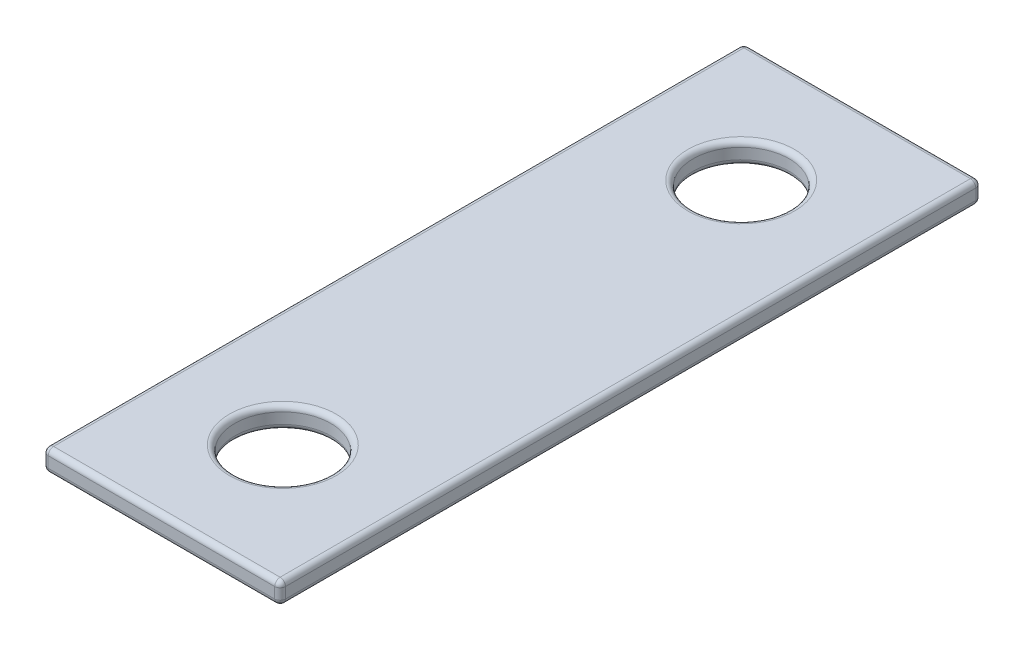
ISO-10303-21;
HEADER;
FILE_DESCRIPTION(('STEP AP214'),'2;1');
FILE_NAME('part.step','',(''),(''),'','','');
FILE_SCHEMA(('AUTOMOTIVE_DESIGN { 1 0 10303 214 1 1 1 1 }'));
ENDSEC;
DATA;
#1=APPLICATION_CONTEXT('core data for automotive mechanical design processes');
#2=APPLICATION_PROTOCOL_DEFINITION('international standard','automotive_design',2000,#1);
#3=PRODUCT_CONTEXT('',#1,'mechanical');
#4=PRODUCT('Part','Part','',(#3));
#5=PRODUCT_RELATED_PRODUCT_CATEGORY('part','',(#4));
#6=PRODUCT_DEFINITION_FORMATION('','',#4);
#7=PRODUCT_DEFINITION_CONTEXT('part definition',#1,'design');
#8=PRODUCT_DEFINITION('design','',#6,#7);
#9=PRODUCT_DEFINITION_SHAPE('','',#8);
#10=(LENGTH_UNIT() NAMED_UNIT(*) SI_UNIT(.MILLI.,.METRE.));
#11=(NAMED_UNIT(*) PLANE_ANGLE_UNIT() SI_UNIT($,.RADIAN.));
#12=(NAMED_UNIT(*) SI_UNIT($,.STERADIAN.) SOLID_ANGLE_UNIT());
#13=UNCERTAINTY_MEASURE_WITH_UNIT(LENGTH_MEASURE(1.E-05),#10,'distance_accuracy_value','');
#14=(GEOMETRIC_REPRESENTATION_CONTEXT(3) GLOBAL_UNCERTAINTY_ASSIGNED_CONTEXT((#13)) GLOBAL_UNIT_ASSIGNED_CONTEXT((#10,
#11,#12)) REPRESENTATION_CONTEXT('',''));
#15=CARTESIAN_POINT('',(0.,0.,0.));
#16=DIRECTION('',(0.,0.,1.));
#17=DIRECTION('',(1.,0.,0.));
#18=AXIS2_PLACEMENT_3D('',#15,#16,#17);
#19=CARTESIAN_POINT('',(0.,0.508,0.));
#20=DIRECTION('',(0.,1.,0.));
#21=DIRECTION('',(0.,0.,1.));
#22=AXIS2_PLACEMENT_3D('',#19,#20,#21);
#23=PLANE('',#22);
#24=CARTESIAN_POINT('',(-3.92978409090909,0.508,-4.79857954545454));
#25=DIRECTION('',(0.,1.,0.));
#26=DIRECTION('',(0.,0.,1.));
#27=AXIS2_PLACEMENT_3D('',#24,#25,#26);
#28=CIRCLE('',#27,1.2573);
#29=CARTESIAN_POINT('',(-3.92978409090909,0.508,-3.54127954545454));
#30=VERTEX_POINT('',#29);
#31=EDGE_CURVE('E596',#30,#30,#28,.F.);
#32=ORIENTED_EDGE('',*,*,#31,.T.);
#33=EDGE_LOOP('',(#32));
#34=FACE_BOUND('',#33,.T.);
#35=CARTESIAN_POINT('',(-3.92978409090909,0.508,5.99642045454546));
#36=DIRECTION('',(0.,1.,0.));
#37=DIRECTION('',(0.,0.,1.));
#38=AXIS2_PLACEMENT_3D('',#35,#36,#37);
#39=CIRCLE('',#38,1.2573);
#40=CARTESIAN_POINT('',(-3.92978409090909,0.508,7.25372045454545));
#41=VERTEX_POINT('',#40);
#42=EDGE_CURVE('E242',#41,#41,#39,.F.);
#43=ORIENTED_EDGE('',*,*,#42,.T.);
#44=EDGE_LOOP('',(#43));
#45=FACE_BOUND('',#44,.T.);
#46=DIRECTION('',(0.,0.,-1.));
#47=VECTOR('',#46,1.);
#48=CARTESIAN_POINT('',(-1.26278409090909,0.508,-7.65607954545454));
#49=LINE('',#48,#47);
#50=CARTESIAN_POINT('',(-1.26278409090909,0.508,8.72692045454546));
#51=VERTEX_POINT('',#50);
#52=CARTESIAN_POINT('',(-1.26278409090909,0.508,-7.52907954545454));
#53=VERTEX_POINT('',#52);
#54=EDGE_CURVE('E243',#51,#53,#49,.T.);
#55=ORIENTED_EDGE('',*,*,#54,.T.);
#56=DIRECTION('',(-1.,0.,0.));
#57=VECTOR('',#56,1.);
#58=CARTESIAN_POINT('',(-6.72378409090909,0.508,-7.52907954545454));
#59=LINE('',#58,#57);
#60=CARTESIAN_POINT('',(-6.59678409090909,0.508,-7.52907954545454));
#61=VERTEX_POINT('',#60);
#62=EDGE_CURVE('E239',#53,#61,#59,.T.);
#63=ORIENTED_EDGE('',*,*,#62,.T.);
#64=DIRECTION('',(0.,0.,1.));
#65=VECTOR('',#64,1.);
#66=CARTESIAN_POINT('',(-6.59678409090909,0.508,8.85392045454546));
#67=LINE('',#66,#65);
#68=CARTESIAN_POINT('',(-6.59678409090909,0.508,8.72692045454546));
#69=VERTEX_POINT('',#68);
#70=EDGE_CURVE('E284',#61,#69,#67,.T.);
#71=ORIENTED_EDGE('',*,*,#70,.T.);
#72=DIRECTION('',(1.,0.,0.));
#73=VECTOR('',#72,1.);
#74=CARTESIAN_POINT('',(-1.13578409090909,0.508,8.72692045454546));
#75=LINE('',#74,#73);
#76=EDGE_CURVE('E584',#69,#51,#75,.T.);
#77=ORIENTED_EDGE('',*,*,#76,.T.);
#78=EDGE_LOOP('',(#55,#63,#71,#77));
#79=FACE_BOUND('',#78,.T.);
#80=ADVANCED_FACE('F32',(#34,#45,#79),#23,.T.);
#81=CARTESIAN_POINT('',(0.,0.,0.));
#82=DIRECTION('',(0.,1.,0.));
#83=DIRECTION('',(0.,0.,1.));
#84=AXIS2_PLACEMENT_3D('',#81,#82,#83);
#85=PLANE('',#84);
#86=CARTESIAN_POINT('',(-3.92978409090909,0.,-4.79857954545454));
#87=DIRECTION('',(0.,1.,0.));
#88=DIRECTION('',(0.,0.,1.));
#89=AXIS2_PLACEMENT_3D('',#86,#87,#88);
#90=CIRCLE('',#89,1.2573);
#91=CARTESIAN_POINT('',(-3.92978409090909,0.,-3.54127954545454));
#92=VERTEX_POINT('',#91);
#93=EDGE_CURVE('E582',#92,#92,#90,.T.);
#94=ORIENTED_EDGE('',*,*,#93,.T.);
#95=EDGE_LOOP('',(#94));
#96=FACE_BOUND('',#95,.T.);
#97=CARTESIAN_POINT('',(-3.92978409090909,0.,5.99642045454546));
#98=DIRECTION('',(0.,1.,0.));
#99=DIRECTION('',(0.,0.,1.));
#100=AXIS2_PLACEMENT_3D('',#97,#98,#99);
#101=CIRCLE('',#100,1.2573);
#102=CARTESIAN_POINT('',(-3.92978409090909,0.,7.25372045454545));
#103=VERTEX_POINT('',#102);
#104=EDGE_CURVE('E587',#103,#103,#101,.T.);
#105=ORIENTED_EDGE('',*,*,#104,.T.);
#106=EDGE_LOOP('',(#105));
#107=FACE_BOUND('',#106,.T.);
#108=DIRECTION('',(0.,0.,1.));
#109=VECTOR('',#108,1.);
#110=CARTESIAN_POINT('',(-6.59678409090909,0.,0.));
#111=LINE('',#110,#109);
#112=CARTESIAN_POINT('',(-6.59678409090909,0.,8.72692045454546));
#113=VERTEX_POINT('',#112);
#114=CARTESIAN_POINT('',(-6.59678409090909,0.,-7.52907954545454));
#115=VERTEX_POINT('',#114);
#116=EDGE_CURVE('E134',#113,#115,#111,.F.);
#117=ORIENTED_EDGE('',*,*,#116,.T.);
#118=DIRECTION('',(-1.,0.,0.));
#119=VECTOR('',#118,1.);
#120=CARTESIAN_POINT('',(0.,0.,-7.52907954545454));
#121=LINE('',#120,#119);
#122=CARTESIAN_POINT('',(-1.26278409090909,0.,-7.52907954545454));
#123=VERTEX_POINT('',#122);
#124=EDGE_CURVE('E130',#115,#123,#121,.F.);
#125=ORIENTED_EDGE('',*,*,#124,.T.);
#126=DIRECTION('',(0.,0.,-1.));
#127=VECTOR('',#126,1.);
#128=CARTESIAN_POINT('',(-1.26278409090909,0.,0.));
#129=LINE('',#128,#127);
#130=CARTESIAN_POINT('',(-1.26278409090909,0.,8.72692045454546));
#131=VERTEX_POINT('',#130);
#132=EDGE_CURVE('E124',#123,#131,#129,.F.);
#133=ORIENTED_EDGE('',*,*,#132,.T.);
#134=DIRECTION('',(1.,0.,0.));
#135=VECTOR('',#134,1.);
#136=CARTESIAN_POINT('',(0.,0.,8.72692045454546));
#137=LINE('',#136,#135);
#138=EDGE_CURVE('E127',#131,#113,#137,.F.);
#139=ORIENTED_EDGE('',*,*,#138,.T.);
#140=EDGE_LOOP('',(#117,#125,#133,#139));
#141=FACE_BOUND('',#140,.T.);
#142=ADVANCED_FACE('F126',(#96,#107,#141),#85,.F.);
#143=CARTESIAN_POINT('',(-6.72378409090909,0.508,-7.65607954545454));
#144=DIRECTION('',(1.,0.,0.));
#145=DIRECTION('',(0.,0.,-1.));
#146=AXIS2_PLACEMENT_3D('',#143,#144,#145);
#147=PLANE('',#146);
#148=DIRECTION('',(0.,0.,1.));
#149=VECTOR('',#148,1.);
#150=CARTESIAN_POINT('',(-6.72378409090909,0.381,-7.65607954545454));
#151=LINE('',#150,#149);
#152=CARTESIAN_POINT('',(-6.72378409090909,0.381,8.72692045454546));
#153=VERTEX_POINT('',#152);
#154=CARTESIAN_POINT('',(-6.72378409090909,0.381,-7.52907954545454));
#155=VERTEX_POINT('',#154);
#156=EDGE_CURVE('E262',#153,#155,#151,.F.);
#157=ORIENTED_EDGE('',*,*,#156,.T.);
#158=DIRECTION('',(0.,-1.,0.));
#159=VECTOR('',#158,1.);
#160=CARTESIAN_POINT('',(-6.72378409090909,0.508,-7.52907954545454));
#161=LINE('',#160,#159);
#162=CARTESIAN_POINT('',(-6.72378409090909,0.127,-7.52907954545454));
#163=VERTEX_POINT('',#162);
#164=EDGE_CURVE('E269',#155,#163,#161,.T.);
#165=ORIENTED_EDGE('',*,*,#164,.T.);
#166=DIRECTION('',(0.,0.,1.));
#167=VECTOR('',#166,1.);
#168=CARTESIAN_POINT('',(-6.72378409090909,0.127,-7.65607954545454));
#169=LINE('',#168,#167);
#170=CARTESIAN_POINT('',(-6.72378409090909,0.127,8.72692045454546));
#171=VERTEX_POINT('',#170);
#172=EDGE_CURVE('E267',#163,#171,#169,.T.);
#173=ORIENTED_EDGE('',*,*,#172,.T.);
#174=DIRECTION('',(0.,-1.,0.));
#175=VECTOR('',#174,1.);
#176=CARTESIAN_POINT('',(-6.72378409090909,0.508,8.72692045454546));
#177=LINE('',#176,#175);
#178=EDGE_CURVE('E260',#171,#153,#177,.F.);
#179=ORIENTED_EDGE('',*,*,#178,.T.);
#180=EDGE_LOOP('',(#157,#165,#173,#179));
#181=FACE_BOUND('',#180,.T.);
#182=ADVANCED_FACE('F273',(#181),#147,.F.);
#183=CARTESIAN_POINT('',(-6.72378409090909,0.508,8.85392045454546));
#184=DIRECTION('',(0.,0.,-1.));
#185=DIRECTION('',(-1.,0.,0.));
#186=AXIS2_PLACEMENT_3D('',#183,#184,#185);
#187=PLANE('',#186);
#188=DIRECTION('',(1.,0.,0.));
#189=VECTOR('',#188,1.);
#190=CARTESIAN_POINT('',(-6.72378409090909,0.381,8.85392045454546));
#191=LINE('',#190,#189);
#192=CARTESIAN_POINT('',(-1.26278409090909,0.381,8.85392045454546));
#193=VERTEX_POINT('',#192);
#194=CARTESIAN_POINT('',(-6.59678409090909,0.381,8.85392045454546));
#195=VERTEX_POINT('',#194);
#196=EDGE_CURVE('E41',#193,#195,#191,.F.);
#197=ORIENTED_EDGE('',*,*,#196,.T.);
#198=DIRECTION('',(0.,-1.,0.));
#199=VECTOR('',#198,1.);
#200=CARTESIAN_POINT('',(-6.59678409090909,0.508,8.85392045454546));
#201=LINE('',#200,#199);
#202=CARTESIAN_POINT('',(-6.59678409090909,0.127,8.85392045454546));
#203=VERTEX_POINT('',#202);
#204=EDGE_CURVE('E11',#195,#203,#201,.T.);
#205=ORIENTED_EDGE('',*,*,#204,.T.);
#206=DIRECTION('',(1.,0.,0.));
#207=VECTOR('',#206,1.);
#208=CARTESIAN_POINT('',(-6.72378409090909,0.127,8.85392045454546));
#209=LINE('',#208,#207);
#210=CARTESIAN_POINT('',(-1.26278409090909,0.127,8.85392045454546));
#211=VERTEX_POINT('',#210);
#212=EDGE_CURVE('E212',#203,#211,#209,.T.);
#213=ORIENTED_EDGE('',*,*,#212,.T.);
#214=DIRECTION('',(0.,-1.,0.));
#215=VECTOR('',#214,1.);
#216=CARTESIAN_POINT('',(-1.26278409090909,0.508,8.85392045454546));
#217=LINE('',#216,#215);
#218=EDGE_CURVE('E209',#211,#193,#217,.F.);
#219=ORIENTED_EDGE('',*,*,#218,.T.);
#220=EDGE_LOOP('',(#197,#205,#213,#219));
#221=FACE_BOUND('',#220,.T.);
#222=ADVANCED_FACE('F207',(#221),#187,.F.);
#223=CARTESIAN_POINT('',(-1.13578409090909,0.508,8.85392045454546));
#224=DIRECTION('',(-1.,0.,0.));
#225=DIRECTION('',(0.,0.,1.));
#226=AXIS2_PLACEMENT_3D('',#223,#224,#225);
#227=PLANE('',#226);
#228=DIRECTION('',(0.,0.,-1.));
#229=VECTOR('',#228,1.);
#230=CARTESIAN_POINT('',(-1.13578409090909,0.127,8.85392045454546));
#231=LINE('',#230,#229);
#232=CARTESIAN_POINT('',(-1.13578409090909,0.127,8.72692045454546));
#233=VERTEX_POINT('',#232);
#234=CARTESIAN_POINT('',(-1.13578409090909,0.127,-7.52907954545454));
#235=VERTEX_POINT('',#234);
#236=EDGE_CURVE('E157',#233,#235,#231,.T.);
#237=ORIENTED_EDGE('',*,*,#236,.T.);
#238=DIRECTION('',(0.,-1.,0.));
#239=VECTOR('',#238,1.);
#240=CARTESIAN_POINT('',(-1.13578409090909,0.508,-7.52907954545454));
#241=LINE('',#240,#239);
#242=CARTESIAN_POINT('',(-1.13578409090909,0.381,-7.52907954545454));
#243=VERTEX_POINT('',#242);
#244=EDGE_CURVE('E256',#235,#243,#241,.F.);
#245=ORIENTED_EDGE('',*,*,#244,.T.);
#246=DIRECTION('',(0.,0.,-1.));
#247=VECTOR('',#246,1.);
#248=CARTESIAN_POINT('',(-1.13578409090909,0.381,8.85392045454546));
#249=LINE('',#248,#247);
#250=CARTESIAN_POINT('',(-1.13578409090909,0.381,8.72692045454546));
#251=VERTEX_POINT('',#250);
#252=EDGE_CURVE('E248',#243,#251,#249,.F.);
#253=ORIENTED_EDGE('',*,*,#252,.T.);
#254=DIRECTION('',(0.,-1.,0.));
#255=VECTOR('',#254,1.);
#256=CARTESIAN_POINT('',(-1.13578409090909,0.508,8.72692045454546));
#257=LINE('',#256,#255);
#258=EDGE_CURVE('E253',#251,#233,#257,.T.);
#259=ORIENTED_EDGE('',*,*,#258,.T.);
#260=EDGE_LOOP('',(#237,#245,#253,#259));
#261=FACE_BOUND('',#260,.T.);
#262=ADVANCED_FACE('F257',(#261),#227,.F.);
#263=CARTESIAN_POINT('',(-6.72378409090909,0.508,-7.65607954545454));
#264=DIRECTION('',(0.,0.,1.));
#265=DIRECTION('',(1.,0.,0.));
#266=AXIS2_PLACEMENT_3D('',#263,#264,#265);
#267=PLANE('',#266);
#268=DIRECTION('',(0.,-1.,0.));
#269=VECTOR('',#268,1.);
#270=CARTESIAN_POINT('',(-6.59678409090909,0.508,-7.65607954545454));
#271=LINE('',#270,#269);
#272=CARTESIAN_POINT('',(-6.59678409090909,0.127,-7.65607954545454));
#273=VERTEX_POINT('',#272);
#274=CARTESIAN_POINT('',(-6.59678409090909,0.381,-7.65607954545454));
#275=VERTEX_POINT('',#274);
#276=EDGE_CURVE('E606',#273,#275,#271,.F.);
#277=ORIENTED_EDGE('',*,*,#276,.T.);
#278=DIRECTION('',(-1.,0.,0.));
#279=VECTOR('',#278,1.);
#280=CARTESIAN_POINT('',(-1.13578409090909,0.381,-7.65607954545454));
#281=LINE('',#280,#279);
#282=CARTESIAN_POINT('',(-1.26278409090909,0.381,-7.65607954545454));
#283=VERTEX_POINT('',#282);
#284=EDGE_CURVE('E237',#275,#283,#281,.F.);
#285=ORIENTED_EDGE('',*,*,#284,.T.);
#286=DIRECTION('',(0.,-1.,0.));
#287=VECTOR('',#286,1.);
#288=CARTESIAN_POINT('',(-1.26278409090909,0.508,-7.65607954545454));
#289=LINE('',#288,#287);
#290=CARTESIAN_POINT('',(-1.26278409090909,0.127,-7.65607954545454));
#291=VERTEX_POINT('',#290);
#292=EDGE_CURVE('E608',#283,#291,#289,.T.);
#293=ORIENTED_EDGE('',*,*,#292,.T.);
#294=DIRECTION('',(-1.,0.,0.));
#295=VECTOR('',#294,1.);
#296=CARTESIAN_POINT('',(-6.72378409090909,0.127,-7.65607954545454));
#297=LINE('',#296,#295);
#298=EDGE_CURVE('E604',#291,#273,#297,.T.);
#299=ORIENTED_EDGE('',*,*,#298,.T.);
#300=EDGE_LOOP('',(#277,#285,#293,#299));
#301=FACE_BOUND('',#300,.T.);
#302=ADVANCED_FACE('F314',(#301),#267,.F.);
#303=CARTESIAN_POINT('',(-3.92978409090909,0.508,-4.79857954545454));
#304=DIRECTION('',(0.,-1.,0.));
#305=DIRECTION('',(0.,0.,-1.));
#306=AXIS2_PLACEMENT_3D('',#303,#304,#305);
#307=CYLINDRICAL_SURFACE('',#306,1.1303);
#308=CARTESIAN_POINT('',(-3.92978409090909,0.127,-4.79857954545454));
#309=DIRECTION('',(0.,1.,0.));
#310=DIRECTION('',(0.,0.,1.));
#311=AXIS2_PLACEMENT_3D('',#308,#309,#310);
#312=CIRCLE('',#311,1.1303);
#313=CARTESIAN_POINT('',(-3.92978409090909,0.127,-3.66827954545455));
#314=VERTEX_POINT('',#313);
#315=EDGE_CURVE('E577',#314,#314,#312,.F.);
#316=ORIENTED_EDGE('',*,*,#315,.T.);
#317=EDGE_LOOP('',(#316));
#318=FACE_BOUND('',#317,.T.);
#319=CARTESIAN_POINT('',(-3.92978409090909,0.381,-4.79857954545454));
#320=DIRECTION('',(0.,1.,0.));
#321=DIRECTION('',(0.,0.,1.));
#322=AXIS2_PLACEMENT_3D('',#319,#320,#321);
#323=CIRCLE('',#322,1.1303);
#324=CARTESIAN_POINT('',(-3.92978409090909,0.381,-3.66827954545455));
#325=VERTEX_POINT('',#324);
#326=EDGE_CURVE('E580',#325,#325,#323,.T.);
#327=ORIENTED_EDGE('',*,*,#326,.T.);
#328=EDGE_LOOP('',(#327));
#329=FACE_BOUND('',#328,.T.);
#330=ADVANCED_FACE('F311',(#318,#329),#307,.F.);
#331=CARTESIAN_POINT('',(-3.92978409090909,0.508,5.99642045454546));
#332=DIRECTION('',(0.,-1.,0.));
#333=DIRECTION('',(0.,0.,-1.));
#334=AXIS2_PLACEMENT_3D('',#331,#332,#333);
#335=CYLINDRICAL_SURFACE('',#334,1.1303);
#336=CARTESIAN_POINT('',(-3.92978409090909,0.127,5.99642045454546));
#337=DIRECTION('',(0.,1.,0.));
#338=DIRECTION('',(0.,0.,1.));
#339=AXIS2_PLACEMENT_3D('',#336,#337,#338);
#340=CIRCLE('',#339,1.1303);
#341=CARTESIAN_POINT('',(-3.92978409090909,0.127,7.12672045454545));
#342=VERTEX_POINT('',#341);
#343=EDGE_CURVE('E601',#342,#342,#340,.F.);
#344=ORIENTED_EDGE('',*,*,#343,.T.);
#345=EDGE_LOOP('',(#344));
#346=FACE_BOUND('',#345,.T.);
#347=CARTESIAN_POINT('',(-3.92978409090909,0.381,5.99642045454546));
#348=DIRECTION('',(0.,1.,0.));
#349=DIRECTION('',(0.,0.,1.));
#350=AXIS2_PLACEMENT_3D('',#347,#348,#349);
#351=CIRCLE('',#350,1.1303);
#352=CARTESIAN_POINT('',(-3.92978409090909,0.381,7.12672045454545));
#353=VERTEX_POINT('',#352);
#354=EDGE_CURVE('E598',#353,#353,#351,.T.);
#355=ORIENTED_EDGE('',*,*,#354,.T.);
#356=EDGE_LOOP('',(#355));
#357=FACE_BOUND('',#356,.T.);
#358=ADVANCED_FACE('F328',(#346,#357),#335,.F.);
#359=CARTESIAN_POINT('',(-3.92978409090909,0.127,-4.79857954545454));
#360=DIRECTION('',(0.,1.,0.));
#361=DIRECTION('',(0.,0.,1.));
#362=AXIS2_PLACEMENT_3D('',#359,#360,#361);
#363=TOROIDAL_SURFACE('',#362,1.2573,0.127);
#364=ORIENTED_EDGE('',*,*,#315,.F.);
#365=EDGE_LOOP('',(#364));
#366=FACE_BOUND('',#365,.T.);
#367=ORIENTED_EDGE('',*,*,#93,.F.);
#368=EDGE_LOOP('',(#367));
#369=FACE_BOUND('',#368,.T.);
#370=ADVANCED_FACE('F324',(#366,#369),#363,.T.);
#371=CARTESIAN_POINT('',(-3.92978409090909,0.381,-4.79857954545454));
#372=DIRECTION('',(0.,1.,0.));
#373=DIRECTION('',(0.,0.,1.));
#374=AXIS2_PLACEMENT_3D('',#371,#372,#373);
#375=TOROIDAL_SURFACE('',#374,1.2573,0.127);
#376=ORIENTED_EDGE('',*,*,#31,.F.);
#377=EDGE_LOOP('',(#376));
#378=FACE_BOUND('',#377,.T.);
#379=ORIENTED_EDGE('',*,*,#326,.F.);
#380=EDGE_LOOP('',(#379));
#381=FACE_BOUND('',#380,.T.);
#382=ADVANCED_FACE('F327',(#378,#381),#375,.T.);
#383=CARTESIAN_POINT('',(-3.92978409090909,0.127,5.99642045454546));
#384=DIRECTION('',(0.,1.,0.));
#385=DIRECTION('',(0.,0.,1.));
#386=AXIS2_PLACEMENT_3D('',#383,#384,#385);
#387=TOROIDAL_SURFACE('',#386,1.2573,0.127);
#388=ORIENTED_EDGE('',*,*,#343,.F.);
#389=EDGE_LOOP('',(#388));
#390=FACE_BOUND('',#389,.T.);
#391=ORIENTED_EDGE('',*,*,#104,.F.);
#392=EDGE_LOOP('',(#391));
#393=FACE_BOUND('',#392,.T.);
#394=ADVANCED_FACE('F332',(#390,#393),#387,.T.);
#395=CARTESIAN_POINT('',(-3.92978409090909,0.381,5.99642045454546));
#396=DIRECTION('',(0.,1.,0.));
#397=DIRECTION('',(0.,0.,1.));
#398=AXIS2_PLACEMENT_3D('',#395,#396,#397);
#399=TOROIDAL_SURFACE('',#398,1.2573,0.127);
#400=ORIENTED_EDGE('',*,*,#42,.F.);
#401=EDGE_LOOP('',(#400));
#402=FACE_BOUND('',#401,.T.);
#403=ORIENTED_EDGE('',*,*,#354,.F.);
#404=EDGE_LOOP('',(#403));
#405=FACE_BOUND('',#404,.T.);
#406=ADVANCED_FACE('F336',(#402,#405),#399,.T.);
#407=CARTESIAN_POINT('',(-6.59678409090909,0.508,8.72692045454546));
#408=DIRECTION('',(0.,-1.,0.));
#409=DIRECTION('',(0.,0.,-1.));
#410=AXIS2_PLACEMENT_3D('',#407,#408,#409);
#411=CYLINDRICAL_SURFACE('',#410,0.127);
#412=CARTESIAN_POINT('',(-6.59678409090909,0.381,8.72692045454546));
#413=DIRECTION('',(0.,1.,0.));
#414=DIRECTION('',(0.,0.,1.));
#415=AXIS2_PLACEMENT_3D('',#412,#413,#414);
#416=CIRCLE('',#415,0.127);
#417=EDGE_CURVE('E36',#153,#195,#416,.T.);
#418=ORIENTED_EDGE('',*,*,#417,.F.);
#419=ORIENTED_EDGE('',*,*,#178,.F.);
#420=CARTESIAN_POINT('',(-6.59678409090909,0.127,8.72692045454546));
#421=DIRECTION('',(0.,-1.,0.));
#422=DIRECTION('',(0.,0.,-1.));
#423=AXIS2_PLACEMENT_3D('',#420,#421,#422);
#424=CIRCLE('',#423,0.127);
#425=EDGE_CURVE('E197',#203,#171,#424,.T.);
#426=ORIENTED_EDGE('',*,*,#425,.F.);
#427=ORIENTED_EDGE('',*,*,#204,.F.);
#428=EDGE_LOOP('',(#418,#419,#426,#427));
#429=FACE_BOUND('',#428,.T.);
#430=ADVANCED_FACE('F34',(#429),#411,.T.);
#431=CARTESIAN_POINT('',(-6.59678409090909,0.381,8.72692045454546));
#432=DIRECTION('',(0.,0.,1.));
#433=DIRECTION('',(1.,0.,0.));
#434=AXIS2_PLACEMENT_3D('',#431,#432,#433);
#435=SPHERICAL_SURFACE('',#434,0.127);
#436=CARTESIAN_POINT('',(-6.59678409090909,0.381,8.72692045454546));
#437=DIRECTION('',(0.,0.,1.));
#438=DIRECTION('',(1.,0.,0.));
#439=AXIS2_PLACEMENT_3D('',#436,#437,#438);
#440=CIRCLE('',#439,0.127);
#441=EDGE_CURVE('E194',#153,#69,#440,.F.);
#442=ORIENTED_EDGE('',*,*,#441,.F.);
#443=ORIENTED_EDGE('',*,*,#417,.T.);
#444=CARTESIAN_POINT('',(-6.59678409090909,0.381,8.72692045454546));
#445=DIRECTION('',(-1.,0.,0.));
#446=DIRECTION('',(0.,0.,1.));
#447=AXIS2_PLACEMENT_3D('',#444,#445,#446);
#448=CIRCLE('',#447,0.127);
#449=EDGE_CURVE('E49',#69,#195,#448,.F.);
#450=ORIENTED_EDGE('',*,*,#449,.F.);
#451=EDGE_LOOP('',(#442,#443,#450));
#452=FACE_BOUND('',#451,.T.);
#453=ADVANCED_FACE('F203',(#452),#435,.T.);
#454=CARTESIAN_POINT('',(-6.59678409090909,0.127,8.72692045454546));
#455=DIRECTION('',(0.,0.,1.));
#456=DIRECTION('',(1.,0.,0.));
#457=AXIS2_PLACEMENT_3D('',#454,#455,#456);
#458=SPHERICAL_SURFACE('',#457,0.127);
#459=CARTESIAN_POINT('',(-6.59678409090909,0.127,8.72692045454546));
#460=DIRECTION('',(-1.,0.,0.));
#461=DIRECTION('',(0.,0.,1.));
#462=AXIS2_PLACEMENT_3D('',#459,#460,#461);
#463=CIRCLE('',#462,0.127);
#464=EDGE_CURVE('E144',#203,#113,#463,.F.);
#465=ORIENTED_EDGE('',*,*,#464,.F.);
#466=ORIENTED_EDGE('',*,*,#425,.T.);
#467=CARTESIAN_POINT('',(-6.59678409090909,0.127,8.72692045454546));
#468=DIRECTION('',(0.,0.,1.));
#469=DIRECTION('',(1.,0.,0.));
#470=AXIS2_PLACEMENT_3D('',#467,#468,#469);
#471=CIRCLE('',#470,0.127);
#472=EDGE_CURVE('E191',#113,#171,#471,.F.);
#473=ORIENTED_EDGE('',*,*,#472,.F.);
#474=EDGE_LOOP('',(#465,#466,#473));
#475=FACE_BOUND('',#474,.T.);
#476=ADVANCED_FACE('F469',(#475),#458,.T.);
#477=CARTESIAN_POINT('',(0.,0.381,8.72692045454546));
#478=DIRECTION('',(-1.,0.,0.));
#479=DIRECTION('',(0.,0.,1.));
#480=AXIS2_PLACEMENT_3D('',#477,#478,#479);
#481=CYLINDRICAL_SURFACE('',#480,0.127);
#482=ORIENTED_EDGE('',*,*,#449,.T.);
#483=ORIENTED_EDGE('',*,*,#196,.F.);
#484=CARTESIAN_POINT('',(-1.26278409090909,0.381,8.72692045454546));
#485=DIRECTION('',(1.,0.,0.));
#486=DIRECTION('',(0.,0.,-1.));
#487=AXIS2_PLACEMENT_3D('',#484,#485,#486);
#488=CIRCLE('',#487,0.127);
#489=EDGE_CURVE('E184',#51,#193,#488,.T.);
#490=ORIENTED_EDGE('',*,*,#489,.F.);
#491=ORIENTED_EDGE('',*,*,#76,.F.);
#492=EDGE_LOOP('',(#482,#483,#490,#491));
#493=FACE_BOUND('',#492,.T.);
#494=ADVANCED_FACE('F461',(#493),#481,.T.);
#495=CARTESIAN_POINT('',(-6.59678409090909,0.381,0.));
#496=DIRECTION('',(0.,0.,-1.));
#497=DIRECTION('',(-1.,0.,0.));
#498=AXIS2_PLACEMENT_3D('',#495,#496,#497);
#499=CYLINDRICAL_SURFACE('',#498,0.127);
#500=ORIENTED_EDGE('',*,*,#441,.T.);
#501=ORIENTED_EDGE('',*,*,#70,.F.);
#502=CARTESIAN_POINT('',(-6.59678409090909,0.381,-7.52907954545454));
#503=DIRECTION('',(0.,0.,-1.));
#504=DIRECTION('',(-1.,0.,0.));
#505=AXIS2_PLACEMENT_3D('',#502,#503,#504);
#506=CIRCLE('',#505,0.127);
#507=EDGE_CURVE('E181',#155,#61,#506,.T.);
#508=ORIENTED_EDGE('',*,*,#507,.F.);
#509=ORIENTED_EDGE('',*,*,#156,.F.);
#510=EDGE_LOOP('',(#500,#501,#508,#509));
#511=FACE_BOUND('',#510,.T.);
#512=ADVANCED_FACE('F283',(#511),#499,.T.);
#513=CARTESIAN_POINT('',(-6.59678409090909,0.508,-7.52907954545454));
#514=DIRECTION('',(0.,-1.,0.));
#515=DIRECTION('',(0.,0.,-1.));
#516=AXIS2_PLACEMENT_3D('',#513,#514,#515);
#517=CYLINDRICAL_SURFACE('',#516,0.127);
#518=CARTESIAN_POINT('',(-6.59678409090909,0.127,-7.52907954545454));
#519=DIRECTION('',(0.,-1.,0.));
#520=DIRECTION('',(0.,0.,-1.));
#521=AXIS2_PLACEMENT_3D('',#518,#519,#520);
#522=CIRCLE('',#521,0.127);
#523=EDGE_CURVE('E175',#163,#273,#522,.T.);
#524=ORIENTED_EDGE('',*,*,#523,.F.);
#525=ORIENTED_EDGE('',*,*,#164,.F.);
#526=CARTESIAN_POINT('',(-6.59678409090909,0.381,-7.52907954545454));
#527=DIRECTION('',(0.,1.,0.));
#528=DIRECTION('',(0.,0.,1.));
#529=AXIS2_PLACEMENT_3D('',#526,#527,#528);
#530=CIRCLE('',#529,0.127);
#531=EDGE_CURVE('E178',#275,#155,#530,.T.);
#532=ORIENTED_EDGE('',*,*,#531,.F.);
#533=ORIENTED_EDGE('',*,*,#276,.F.);
#534=EDGE_LOOP('',(#524,#525,#532,#533));
#535=FACE_BOUND('',#534,.T.);
#536=ADVANCED_FACE('F279',(#535),#517,.T.);
#537=CARTESIAN_POINT('',(-6.59678409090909,0.127,-7.65607954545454));
#538=DIRECTION('',(0.,0.,1.));
#539=DIRECTION('',(1.,0.,0.));
#540=AXIS2_PLACEMENT_3D('',#537,#538,#539);
#541=CYLINDRICAL_SURFACE('',#540,0.127);
#542=ORIENTED_EDGE('',*,*,#472,.T.);
#543=ORIENTED_EDGE('',*,*,#172,.F.);
#544=CARTESIAN_POINT('',(-6.59678409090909,0.127,-7.52907954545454));
#545=DIRECTION('',(0.,0.,-1.));
#546=DIRECTION('',(-1.,0.,0.));
#547=AXIS2_PLACEMENT_3D('',#544,#545,#546);
#548=CIRCLE('',#547,0.127);
#549=EDGE_CURVE('E154',#115,#163,#548,.T.);
#550=ORIENTED_EDGE('',*,*,#549,.F.);
#551=ORIENTED_EDGE('',*,*,#116,.F.);
#552=EDGE_LOOP('',(#542,#543,#550,#551));
#553=FACE_BOUND('',#552,.T.);
#554=ADVANCED_FACE('F438',(#553),#541,.T.);
#555=CARTESIAN_POINT('',(-6.72378409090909,0.127,8.72692045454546));
#556=DIRECTION('',(1.,0.,0.));
#557=DIRECTION('',(0.,0.,-1.));
#558=AXIS2_PLACEMENT_3D('',#555,#556,#557);
#559=CYLINDRICAL_SURFACE('',#558,0.127);
#560=ORIENTED_EDGE('',*,*,#464,.T.);
#561=ORIENTED_EDGE('',*,*,#138,.F.);
#562=CARTESIAN_POINT('',(-1.26278409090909,0.127,8.72692045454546));
#563=DIRECTION('',(1.,0.,0.));
#564=DIRECTION('',(0.,0.,-1.));
#565=AXIS2_PLACEMENT_3D('',#562,#563,#564);
#566=CIRCLE('',#565,0.127);
#567=EDGE_CURVE('E141',#211,#131,#566,.T.);
#568=ORIENTED_EDGE('',*,*,#567,.F.);
#569=ORIENTED_EDGE('',*,*,#212,.F.);
#570=EDGE_LOOP('',(#560,#561,#568,#569));
#571=FACE_BOUND('',#570,.T.);
#572=ADVANCED_FACE('F139',(#571),#559,.T.);
#573=CARTESIAN_POINT('',(-1.26278409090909,0.508,8.72692045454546));
#574=DIRECTION('',(0.,-1.,0.));
#575=DIRECTION('',(0.,0.,-1.));
#576=AXIS2_PLACEMENT_3D('',#573,#574,#575);
#577=CYLINDRICAL_SURFACE('',#576,0.127);
#578=CARTESIAN_POINT('',(-1.26278409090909,0.381,8.72692045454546));
#579=DIRECTION('',(0.,1.,0.));
#580=DIRECTION('',(0.,0.,1.));
#581=AXIS2_PLACEMENT_3D('',#578,#579,#580);
#582=CIRCLE('',#581,0.127);
#583=EDGE_CURVE('E187',#193,#251,#582,.T.);
#584=ORIENTED_EDGE('',*,*,#583,.F.);
#585=ORIENTED_EDGE('',*,*,#218,.F.);
#586=CARTESIAN_POINT('',(-1.26278409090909,0.127,8.72692045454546));
#587=DIRECTION('',(0.,-1.,0.));
#588=DIRECTION('',(0.,0.,-1.));
#589=AXIS2_PLACEMENT_3D('',#586,#587,#588);
#590=CIRCLE('',#589,0.127);
#591=EDGE_CURVE('E153',#233,#211,#590,.T.);
#592=ORIENTED_EDGE('',*,*,#591,.F.);
#593=ORIENTED_EDGE('',*,*,#258,.F.);
#594=EDGE_LOOP('',(#584,#585,#592,#593));
#595=FACE_BOUND('',#594,.T.);
#596=ADVANCED_FACE('F297',(#595),#577,.T.);
#597=CARTESIAN_POINT('',(-1.26278409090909,0.381,8.72692045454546));
#598=DIRECTION('',(0.,0.,1.));
#599=DIRECTION('',(1.,0.,0.));
#600=AXIS2_PLACEMENT_3D('',#597,#598,#599);
#601=SPHERICAL_SURFACE('',#600,0.127);
#602=ORIENTED_EDGE('',*,*,#489,.T.);
#603=ORIENTED_EDGE('',*,*,#583,.T.);
#604=CARTESIAN_POINT('',(-1.26278409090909,0.381,8.72692045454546));
#605=DIRECTION('',(0.,0.,1.));
#606=DIRECTION('',(1.,0.,0.));
#607=AXIS2_PLACEMENT_3D('',#604,#605,#606);
#608=CIRCLE('',#607,0.127);
#609=EDGE_CURVE('E170',#51,#251,#608,.F.);
#610=ORIENTED_EDGE('',*,*,#609,.F.);
#611=EDGE_LOOP('',(#602,#603,#610));
#612=FACE_BOUND('',#611,.T.);
#613=ADVANCED_FACE('F289',(#612),#601,.T.);
#614=CARTESIAN_POINT('',(-6.59678409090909,0.381,-7.52907954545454));
#615=DIRECTION('',(0.,0.,1.));
#616=DIRECTION('',(1.,0.,0.));
#617=AXIS2_PLACEMENT_3D('',#614,#615,#616);
#618=SPHERICAL_SURFACE('',#617,0.127);
#619=ORIENTED_EDGE('',*,*,#531,.T.);
#620=ORIENTED_EDGE('',*,*,#507,.T.);
#621=CARTESIAN_POINT('',(-6.59678409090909,0.381,-7.52907954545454));
#622=DIRECTION('',(-1.,0.,0.));
#623=DIRECTION('',(0.,0.,1.));
#624=AXIS2_PLACEMENT_3D('',#621,#622,#623);
#625=CIRCLE('',#624,0.127);
#626=EDGE_CURVE('E162',#275,#61,#625,.F.);
#627=ORIENTED_EDGE('',*,*,#626,.F.);
#628=EDGE_LOOP('',(#619,#620,#627));
#629=FACE_BOUND('',#628,.T.);
#630=ADVANCED_FACE('F286',(#629),#618,.T.);
#631=CARTESIAN_POINT('',(-6.59678409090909,0.127,-7.52907954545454));
#632=DIRECTION('',(0.,0.,1.));
#633=DIRECTION('',(1.,0.,0.));
#634=AXIS2_PLACEMENT_3D('',#631,#632,#633);
#635=SPHERICAL_SURFACE('',#634,0.127);
#636=ORIENTED_EDGE('',*,*,#549,.T.);
#637=ORIENTED_EDGE('',*,*,#523,.T.);
#638=CARTESIAN_POINT('',(-6.59678409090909,0.127,-7.52907954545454));
#639=DIRECTION('',(-1.,0.,0.));
#640=DIRECTION('',(0.,0.,1.));
#641=AXIS2_PLACEMENT_3D('',#638,#639,#640);
#642=CIRCLE('',#641,0.127);
#643=EDGE_CURVE('E158',#115,#273,#642,.F.);
#644=ORIENTED_EDGE('',*,*,#643,.F.);
#645=EDGE_LOOP('',(#636,#637,#644));
#646=FACE_BOUND('',#645,.T.);
#647=ADVANCED_FACE('F288',(#646),#635,.T.);
#648=CARTESIAN_POINT('',(-1.26278409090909,0.127,8.72692045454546));
#649=DIRECTION('',(0.,0.,1.));
#650=DIRECTION('',(1.,0.,0.));
#651=AXIS2_PLACEMENT_3D('',#648,#649,#650);
#652=SPHERICAL_SURFACE('',#651,0.127);
#653=ORIENTED_EDGE('',*,*,#591,.T.);
#654=ORIENTED_EDGE('',*,*,#567,.T.);
#655=CARTESIAN_POINT('',(-1.26278409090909,0.127,8.72692045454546));
#656=DIRECTION('',(0.,0.,1.));
#657=DIRECTION('',(1.,0.,0.));
#658=AXIS2_PLACEMENT_3D('',#655,#656,#657);
#659=CIRCLE('',#658,0.127);
#660=EDGE_CURVE('E150',#233,#131,#659,.F.);
#661=ORIENTED_EDGE('',*,*,#660,.F.);
#662=EDGE_LOOP('',(#653,#654,#661));
#663=FACE_BOUND('',#662,.T.);
#664=ADVANCED_FACE('F149',(#663),#652,.T.);
#665=CARTESIAN_POINT('',(-1.26278409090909,0.381,0.));
#666=DIRECTION('',(0.,0.,1.));
#667=DIRECTION('',(1.,0.,0.));
#668=AXIS2_PLACEMENT_3D('',#665,#666,#667);
#669=CYLINDRICAL_SURFACE('',#668,0.127);
#670=ORIENTED_EDGE('',*,*,#609,.T.);
#671=ORIENTED_EDGE('',*,*,#252,.F.);
#672=CARTESIAN_POINT('',(-1.26278409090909,0.381,-7.52907954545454));
#673=DIRECTION('',(0.,0.,-1.));
#674=DIRECTION('',(-1.,0.,0.));
#675=AXIS2_PLACEMENT_3D('',#672,#673,#674);
#676=CIRCLE('',#675,0.127);
#677=EDGE_CURVE('E159',#53,#243,#676,.T.);
#678=ORIENTED_EDGE('',*,*,#677,.F.);
#679=ORIENTED_EDGE('',*,*,#54,.F.);
#680=EDGE_LOOP('',(#670,#671,#678,#679));
#681=FACE_BOUND('',#680,.T.);
#682=ADVANCED_FACE('F247',(#681),#669,.T.);
#683=CARTESIAN_POINT('',(0.,0.381,-7.52907954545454));
#684=DIRECTION('',(1.,0.,0.));
#685=DIRECTION('',(0.,0.,-1.));
#686=AXIS2_PLACEMENT_3D('',#683,#684,#685);
#687=CYLINDRICAL_SURFACE('',#686,0.127);
#688=ORIENTED_EDGE('',*,*,#626,.T.);
#689=ORIENTED_EDGE('',*,*,#62,.F.);
#690=CARTESIAN_POINT('',(-1.26278409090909,0.381,-7.52907954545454));
#691=DIRECTION('',(1.,0.,0.));
#692=DIRECTION('',(0.,1.,0.));
#693=AXIS2_PLACEMENT_3D('',#690,#691,#692);
#694=CIRCLE('',#693,0.127);
#695=EDGE_CURVE('E165',#283,#53,#694,.T.);
#696=ORIENTED_EDGE('',*,*,#695,.F.);
#697=ORIENTED_EDGE('',*,*,#284,.F.);
#698=EDGE_LOOP('',(#688,#689,#696,#697));
#699=FACE_BOUND('',#698,.T.);
#700=ADVANCED_FACE('F236',(#699),#687,.T.);
#701=CARTESIAN_POINT('',(-6.72378409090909,0.127,-7.52907954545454));
#702=DIRECTION('',(-1.,0.,0.));
#703=DIRECTION('',(0.,0.,1.));
#704=AXIS2_PLACEMENT_3D('',#701,#702,#703);
#705=CYLINDRICAL_SURFACE('',#704,0.127);
#706=ORIENTED_EDGE('',*,*,#643,.T.);
#707=ORIENTED_EDGE('',*,*,#298,.F.);
#708=CARTESIAN_POINT('',(-1.26278409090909,0.127,-7.52907954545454));
#709=DIRECTION('',(1.,0.,0.));
#710=DIRECTION('',(0.,0.,-1.));
#711=AXIS2_PLACEMENT_3D('',#708,#709,#710);
#712=CIRCLE('',#711,0.127);
#713=EDGE_CURVE('E223',#123,#291,#712,.T.);
#714=ORIENTED_EDGE('',*,*,#713,.F.);
#715=ORIENTED_EDGE('',*,*,#124,.F.);
#716=EDGE_LOOP('',(#706,#707,#714,#715));
#717=FACE_BOUND('',#716,.T.);
#718=ADVANCED_FACE('F352',(#717),#705,.T.);
#719=CARTESIAN_POINT('',(-1.26278409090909,0.127,8.85392045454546));
#720=DIRECTION('',(0.,0.,-1.));
#721=DIRECTION('',(-1.,0.,0.));
#722=AXIS2_PLACEMENT_3D('',#719,#720,#721);
#723=CYLINDRICAL_SURFACE('',#722,0.127);
#724=ORIENTED_EDGE('',*,*,#660,.T.);
#725=ORIENTED_EDGE('',*,*,#132,.F.);
#726=CARTESIAN_POINT('',(-1.26278409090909,0.127,-7.52907954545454));
#727=DIRECTION('',(0.,0.,-1.));
#728=DIRECTION('',(-1.,0.,0.));
#729=AXIS2_PLACEMENT_3D('',#726,#727,#728);
#730=CIRCLE('',#729,0.127);
#731=EDGE_CURVE('E221',#235,#123,#730,.T.);
#732=ORIENTED_EDGE('',*,*,#731,.F.);
#733=ORIENTED_EDGE('',*,*,#236,.F.);
#734=EDGE_LOOP('',(#724,#725,#732,#733));
#735=FACE_BOUND('',#734,.T.);
#736=ADVANCED_FACE('F156',(#735),#723,.T.);
#737=CARTESIAN_POINT('',(-1.26278409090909,0.381,-7.52907954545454));
#738=DIRECTION('',(0.,0.,1.));
#739=DIRECTION('',(1.,0.,0.));
#740=AXIS2_PLACEMENT_3D('',#737,#738,#739);
#741=SPHERICAL_SURFACE('',#740,0.127);
#742=ORIENTED_EDGE('',*,*,#695,.T.);
#743=ORIENTED_EDGE('',*,*,#677,.T.);
#744=CARTESIAN_POINT('',(-1.26278409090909,0.381,-7.52907954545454));
#745=DIRECTION('',(0.,1.,0.));
#746=DIRECTION('',(0.,0.,1.));
#747=AXIS2_PLACEMENT_3D('',#744,#745,#746);
#748=CIRCLE('',#747,0.127);
#749=EDGE_CURVE('E219',#283,#243,#748,.F.);
#750=ORIENTED_EDGE('',*,*,#749,.F.);
#751=EDGE_LOOP('',(#742,#743,#750));
#752=FACE_BOUND('',#751,.T.);
#753=ADVANCED_FACE('F229',(#752),#741,.T.);
#754=CARTESIAN_POINT('',(-1.26278409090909,0.127,-7.52907954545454));
#755=DIRECTION('',(0.,0.,1.));
#756=DIRECTION('',(1.,0.,0.));
#757=AXIS2_PLACEMENT_3D('',#754,#755,#756);
#758=SPHERICAL_SURFACE('',#757,0.127);
#759=ORIENTED_EDGE('',*,*,#731,.T.);
#760=ORIENTED_EDGE('',*,*,#713,.T.);
#761=CARTESIAN_POINT('',(-1.26278409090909,0.127,-7.52907954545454));
#762=DIRECTION('',(0.,-1.,0.));
#763=DIRECTION('',(0.,0.,-1.));
#764=AXIS2_PLACEMENT_3D('',#761,#762,#763);
#765=CIRCLE('',#764,0.127);
#766=EDGE_CURVE('E217',#235,#291,#765,.F.);
#767=ORIENTED_EDGE('',*,*,#766,.F.);
#768=EDGE_LOOP('',(#759,#760,#767));
#769=FACE_BOUND('',#768,.T.);
#770=ADVANCED_FACE('F344',(#769),#758,.T.);
#771=CARTESIAN_POINT('',(-1.26278409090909,0.508,-7.52907954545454));
#772=DIRECTION('',(0.,-1.,0.));
#773=DIRECTION('',(0.,0.,-1.));
#774=AXIS2_PLACEMENT_3D('',#771,#772,#773);
#775=CYLINDRICAL_SURFACE('',#774,0.127);
#776=ORIENTED_EDGE('',*,*,#749,.T.);
#777=ORIENTED_EDGE('',*,*,#244,.F.);
#778=ORIENTED_EDGE('',*,*,#766,.T.);
#779=ORIENTED_EDGE('',*,*,#292,.F.);
#780=EDGE_LOOP('',(#776,#777,#778,#779));
#781=FACE_BOUND('',#780,.T.);
#782=ADVANCED_FACE('F341',(#781),#775,.T.);
#783=CLOSED_SHELL('',(#80,#142,#182,#222,#262,#302,#330,#358,#370,#382,#394,#406,#430,#453,#476,
#494,#512,#536,#554,#572,#596,#613,#630,#647,#664,#682,#700,#718,#736,#753,#770,#782));
#784=MANIFOLD_SOLID_BREP('B2',#783);
#785=ADVANCED_BREP_SHAPE_REPRESENTATION('',(#18,#784),#14);
#786=SHAPE_DEFINITION_REPRESENTATION(#9,#785);
ENDSEC;
END-ISO-10303-21;
